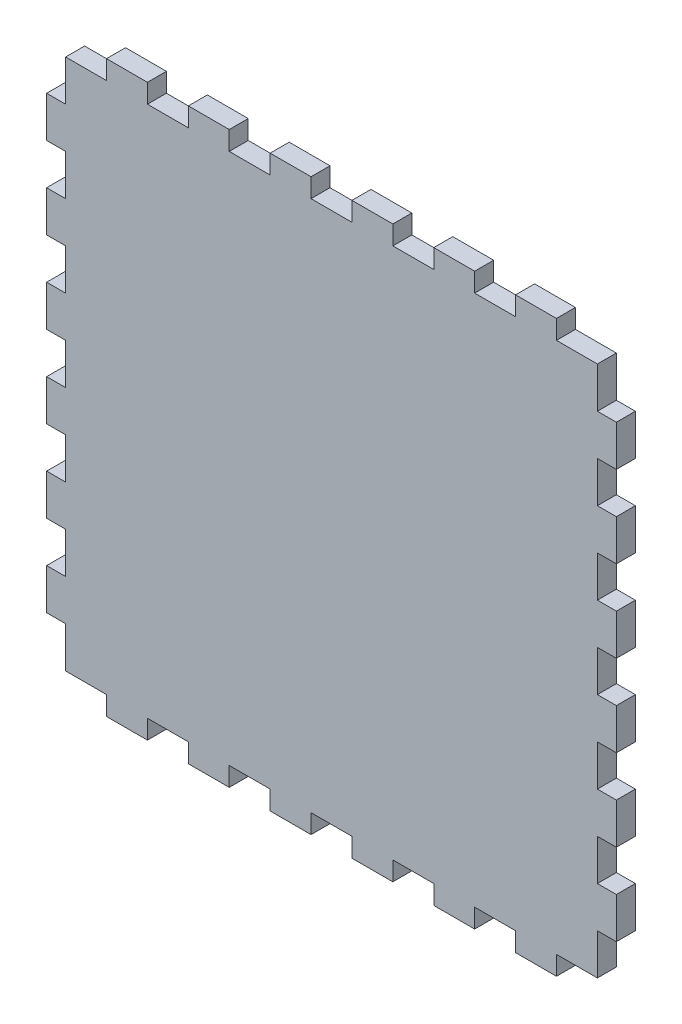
from build123d import *

# Parameters (mm, degrees)
BOSS_EXTRUDE2_DEPTH = 4


with BuildPart() as part:
    # Model → Boss-Extrude2 (new body)
    with BuildSketch(Plane.XY):
        Polygon((83, 286), (91.61, 286), (91.61, 282), (100.23, 282), (100.23, 286), (108.85, 286), (108.85, 282), (117.46, 282), (117.46, 286), (126.08, 286), (126.08, 282), (134.69, 282), (134.69, 286), (143.31, 286), (143.31, 282), (151.92, 282), (151.92, 286), (160.54, 286), (160.54, 282), (169.15, 282), (169.15, 286), (177.77, 286), (177.77, 282), (186.38, 282), (186.38, 286), (195, 286), (195, 294.62), (199, 294.62), (199, 303.23), (195, 303.23), (195, 311.85), (199, 311.85), (199, 320.46), (195, 320.46), (195, 329.08), (199, 329.08), (199, 337.69), (195, 337.69), (195, 346.31), (199, 346.31), (199, 354.92), (195, 354.92), (195, 363.54), (199, 363.54), (199, 372.15), (195, 372.15), (195, 380.77), (199, 380.77), (199, 389.38), (195, 389.38), (195, 398), (186.38, 398), (186.38, 402), (177.77, 402), (177.77, 398), (169.15, 398), (169.15, 402), (160.54, 402), (160.54, 398), (151.92, 398), (151.92, 402), (143.31, 402), (143.31, 398), (134.69, 398), (134.69, 402), (126.08, 402), (126.08, 398), (117.46, 398), (117.46, 402), (108.85, 402), (108.85, 398), (100.23, 398), (100.23, 402), (91.61, 402), (91.61, 398), (83, 398), (83, 389.38), (79, 389.38), (79, 380.77), (83, 380.77), (83, 372.15), (79, 372.15), (79, 363.54), (83, 363.54), (83, 354.92), (79, 354.92), (79, 346.31), (83, 346.31), (83, 337.69), (79, 337.69), (79, 329.08), (83, 329.08), (83, 320.46), (79, 320.46), (79, 311.85), (83, 311.85), (83, 303.23), (79, 303.23), (79, 294.62), (83, 294.62), align=None)
    extrude(amount=BOSS_EXTRUDE2_DEPTH)


solid = part.part
